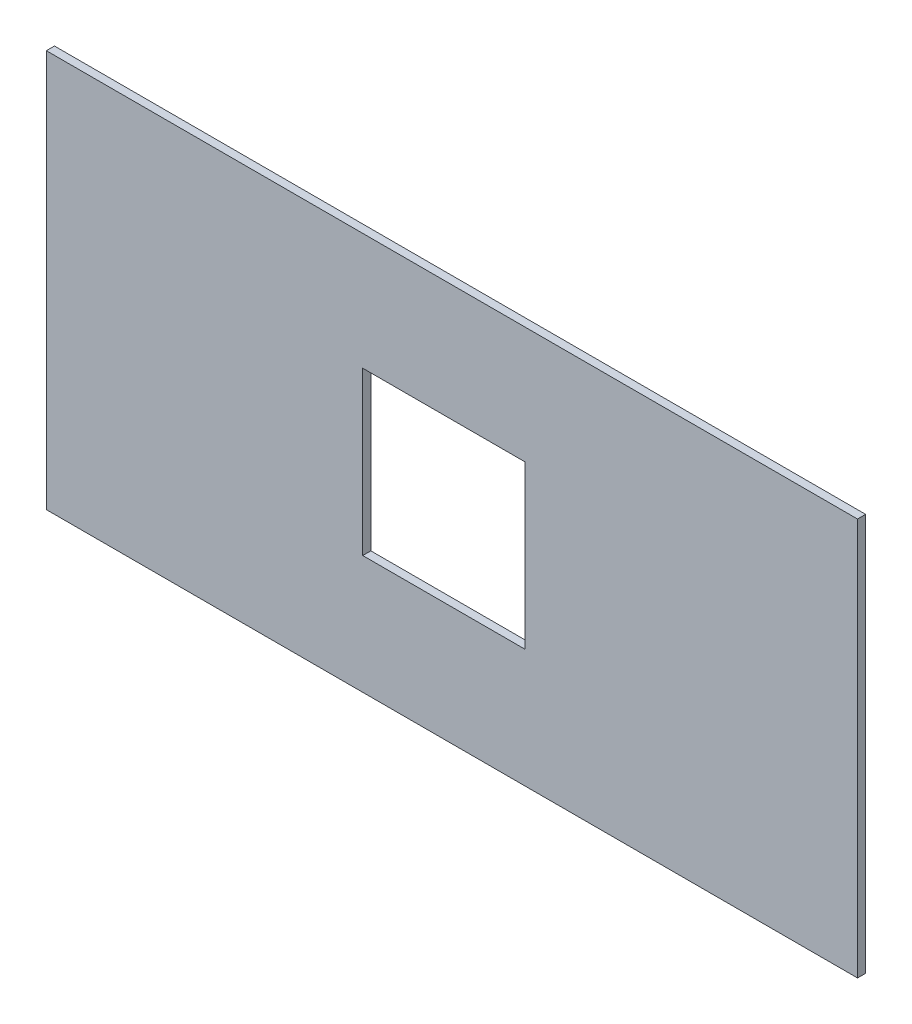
from build123d import *

# Parameters (mm, degrees)
SKETCH1_W           = 635
SKETCH1_H           = 311.15
SKETCH1_W_2         = 127
SKETCH1_H_2         = 127
BOSS_EXTRUDE2_DEPTH = 6.35


with BuildPart() as part:
    # Sketch1 → Boss-Extrude2 (new body)
    with BuildSketch(Plane.XY):
        with Locations((276.934767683, -208.584444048)):
            Rectangle(SKETCH1_W, SKETCH1_H)
        with Locations((270.584767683, -207.93225143)):
            Rectangle(SKETCH1_W_2, SKETCH1_H_2, mode=Mode.SUBTRACT)
    extrude(amount=BOSS_EXTRUDE2_DEPTH)


solid = part.part
